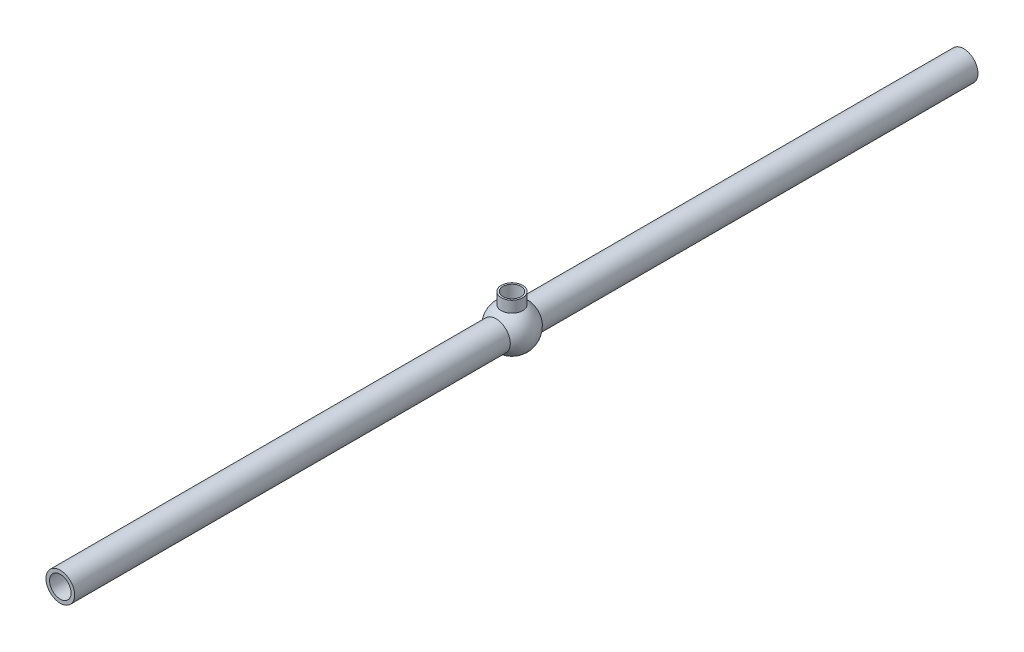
from build123d import *

# Parameters (mm, degrees)
EXTRUDE1_DEPTH                  = 60.453977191
EXTRUDE1_DEPTH_BACK             = 60.453977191
SKETCH2_R                       = 15
SKETCH3_R                       = 20
SKETCH3_R_2                     = 15
EXTRUDE_THIN1_DEPTH             = 600
EXTRUDE_THIN1_DIRECTION_2_REACH = 77.951
SKETCH4_R                       = 20
SKETCH4_R_2                     = 15
EXTRUDE_THIN2_DEPTH             = 600
EXTRUDE_THIN2_DIRECTION_2_REACH = 663.993


with BuildPart() as part:
    # Sketch1 → Revolve1 (revolve)
    with BuildSketch(Plane.XY):
        with BuildLine():
            Line((0, -25), (0, -30))
            ThreePointArc((0, -30), (28.977774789, -7.764571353), (15, 25.980762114))
            Line((15, 25.980762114), (15, 41.650635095))
            Line((15, 41.650635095), (12.5, 41.650635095))
            Line((12.5, 41.650635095), (12.5, 21.650635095))
            ThreePointArc((12.5, 21.650635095), (24.148145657, -6.470476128), (0, -25))
        make_face()
    revolve(axis=Axis((0, 42.006777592, 0), (0, -1, 0)))

    # Sketch2 → Extrude1 (cut, two sides: drawn at the far end of the back side and taken through both)
    with BuildSketch(Plane.XY.offset(-EXTRUDE1_DEPTH_BACK)):
        Circle(SKETCH2_R)
    extrude(amount=EXTRUDE1_DEPTH + EXTRUDE1_DEPTH_BACK, mode=Mode.SUBTRACT)

    # Sketch3 → Extrude-Thin1 (add)
    with BuildSketch(Plane.XY.offset(30)):
        Circle(SKETCH3_R)
        Circle(SKETCH3_R_2, mode=Mode.SUBTRACT)
    extrude(amount=EXTRUDE_THIN1_DEPTH)

    # Sketch3 → Extrude-Thin1 direction 2 (add, up to next)
    with BuildSketch(Plane.XY.offset(30), mode=Mode.PRIVATE) as extrude_thin1_direction_2_sk1:
        Circle(SKETCH3_R)
        Circle(SKETCH3_R_2, mode=Mode.SUBTRACT)
    extrude_thin1_direction_2_tool1 = extrude(extrude_thin1_direction_2_sk1.sketch, amount=-EXTRUDE_THIN1_DIRECTION_2_REACH, mode=Mode.PRIVATE) - part.part
    add(extrude_thin1_direction_2_tool1.solids().sort_by_distance((-19.434315, 0, 30))[0])

    # Sketch4 → Extrude-Thin2 (add)
    with BuildSketch(Plane.XY.offset(-30)):
        Circle(SKETCH4_R)
        Circle(SKETCH4_R_2, mode=Mode.SUBTRACT)
    extrude(amount=-EXTRUDE_THIN2_DEPTH)

    # Sketch4 → Extrude-Thin2 direction 2 (add, up to next)
    with BuildSketch(Plane.XY.offset(-30), mode=Mode.PRIVATE) as extrude_thin2_direction_2_sk1:
        Circle(SKETCH4_R)
        Circle(SKETCH4_R_2, mode=Mode.SUBTRACT)
    extrude_thin2_direction_2_tool1 = extrude(extrude_thin2_direction_2_sk1.sketch, amount=EXTRUDE_THIN2_DIRECTION_2_REACH, mode=Mode.PRIVATE) - part.part
    add(extrude_thin2_direction_2_tool1.solids().sort_by_distance((-19.434315, 0, -30))[0])


solid = part.part
